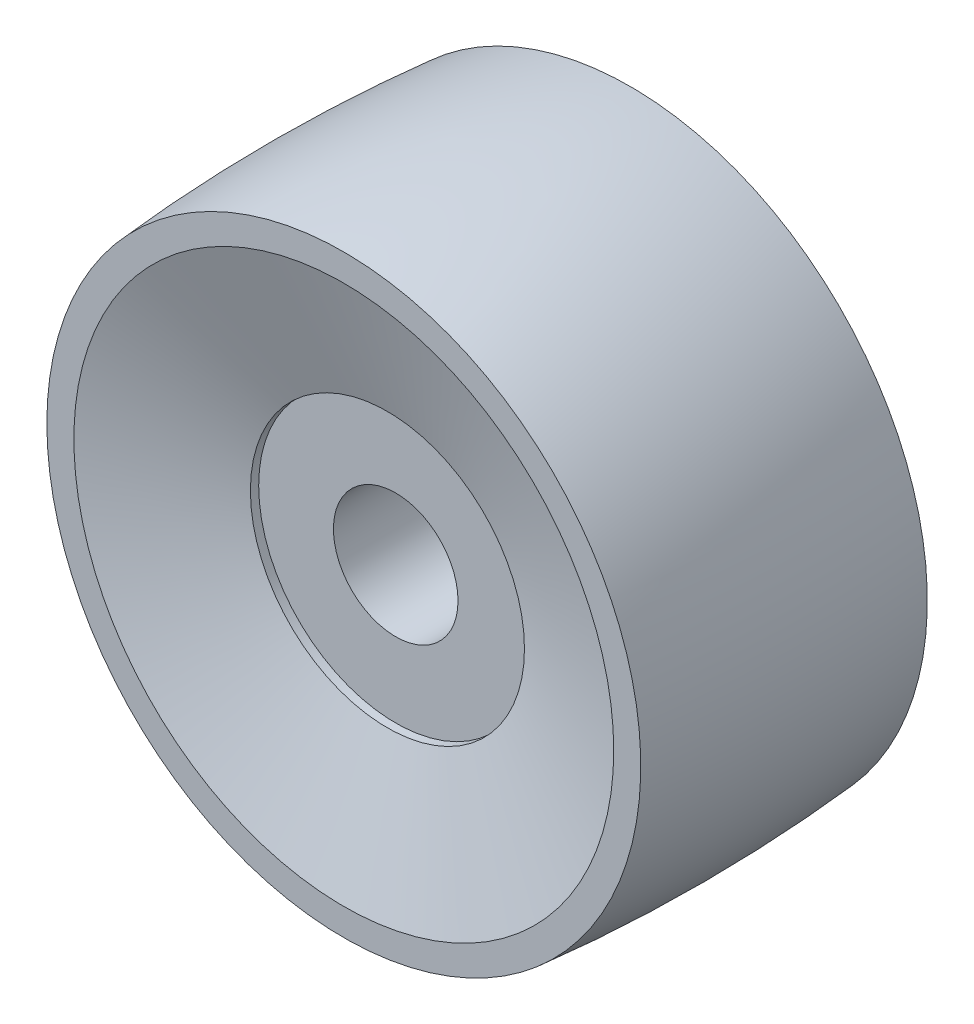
ISO-10303-21;
HEADER;
FILE_DESCRIPTION(('STEP AP214'),'2;1');
FILE_NAME('part.step','',(''),(''),'','','');
FILE_SCHEMA(('AUTOMOTIVE_DESIGN { 1 0 10303 214 1 1 1 1 }'));
ENDSEC;
DATA;
#1=APPLICATION_CONTEXT('core data for automotive mechanical design processes');
#2=APPLICATION_PROTOCOL_DEFINITION('international standard','automotive_design',2000,#1);
#3=PRODUCT_CONTEXT('',#1,'mechanical');
#4=PRODUCT('Part','Part','',(#3));
#5=PRODUCT_RELATED_PRODUCT_CATEGORY('part','',(#4));
#6=PRODUCT_DEFINITION_FORMATION('','',#4);
#7=PRODUCT_DEFINITION_CONTEXT('part definition',#1,'design');
#8=PRODUCT_DEFINITION('design','',#6,#7);
#9=PRODUCT_DEFINITION_SHAPE('','',#8);
#10=(LENGTH_UNIT() NAMED_UNIT(*) SI_UNIT(.MILLI.,.METRE.));
#11=(NAMED_UNIT(*) PLANE_ANGLE_UNIT() SI_UNIT($,.RADIAN.));
#12=(NAMED_UNIT(*) SI_UNIT($,.STERADIAN.) SOLID_ANGLE_UNIT());
#13=UNCERTAINTY_MEASURE_WITH_UNIT(LENGTH_MEASURE(1.E-05),#10,'distance_accuracy_value','');
#14=(GEOMETRIC_REPRESENTATION_CONTEXT(3) GLOBAL_UNCERTAINTY_ASSIGNED_CONTEXT((#13)) GLOBAL_UNIT_ASSIGNED_CONTEXT((#10,
#11,#12)) REPRESENTATION_CONTEXT('',''));
#15=CARTESIAN_POINT('',(0.,0.,0.));
#16=DIRECTION('',(0.,0.,1.));
#17=DIRECTION('',(1.,0.,0.));
#18=AXIS2_PLACEMENT_3D('',#15,#16,#17);
#19=CARTESIAN_POINT('',(0.,-7.5,-11.));
#20=DIRECTION('',(0.,0.,-1.));
#21=DIRECTION('',(1.,0.,0.));
#22=AXIS2_PLACEMENT_3D('',#19,#20,#21);
#23=PLANE('',#22);
#24=CARTESIAN_POINT('',(0.,0.,-11.));
#25=DIRECTION('',(0.,0.,-1.));
#26=DIRECTION('',(1.,0.,0.));
#27=AXIS2_PLACEMENT_3D('',#24,#25,#26);
#28=CIRCLE('',#27,16.5);
#29=CARTESIAN_POINT('',(16.5,0.,-11.));
#30=VERTEX_POINT('',#29);
#31=EDGE_CURVE('E40',#30,#30,#28,.T.);
#32=ORIENTED_EDGE('',*,*,#31,.T.);
#33=EDGE_LOOP('',(#32));
#34=FACE_BOUND('',#33,.T.);
#35=CARTESIAN_POINT('',(0.,0.,-11.));
#36=DIRECTION('',(0.,0.,-1.));
#37=DIRECTION('',(1.,0.,0.));
#38=AXIS2_PLACEMENT_3D('',#35,#36,#37);
#39=CIRCLE('',#38,7.5);
#40=CARTESIAN_POINT('',(7.5,0.,-11.));
#41=VERTEX_POINT('',#40);
#42=EDGE_CURVE('E8',#41,#41,#39,.T.);
#43=ORIENTED_EDGE('',*,*,#42,.F.);
#44=EDGE_LOOP('',(#43));
#45=FACE_BOUND('',#44,.T.);
#46=ADVANCED_FACE('F12',(#34,#45),#23,.T.);
#47=CARTESIAN_POINT('',(0.,0.,-20.));
#48=DIRECTION('',(0.,0.,-1.));
#49=DIRECTION('',(1.,0.,0.));
#50=AXIS2_PLACEMENT_3D('',#47,#48,#49);
#51=CYLINDRICAL_SURFACE('',#50,7.5);
#52=ORIENTED_EDGE('',*,*,#42,.T.);
#53=EDGE_LOOP('',(#52));
#54=FACE_BOUND('',#53,.T.);
#55=CARTESIAN_POINT('',(0.,0.,11.));
#56=DIRECTION('',(0.,0.,-1.));
#57=DIRECTION('',(1.,0.,0.));
#58=AXIS2_PLACEMENT_3D('',#55,#56,#57);
#59=CIRCLE('',#58,7.5);
#60=CARTESIAN_POINT('',(7.5,0.,11.));
#61=VERTEX_POINT('',#60);
#62=EDGE_CURVE('E18',#61,#61,#59,.T.);
#63=ORIENTED_EDGE('',*,*,#62,.F.);
#64=EDGE_LOOP('',(#63));
#65=FACE_BOUND('',#64,.T.);
#66=ADVANCED_FACE('F67',(#54,#65),#51,.F.);
#67=CARTESIAN_POINT('',(0.,-7.5,11.));
#68=DIRECTION('',(0.,0.,-1.));
#69=DIRECTION('',(1.,0.,0.));
#70=AXIS2_PLACEMENT_3D('',#67,#68,#69);
#71=PLANE('',#70);
#72=CARTESIAN_POINT('',(0.,0.,11.));
#73=DIRECTION('',(0.,0.,-1.));
#74=DIRECTION('',(1.,0.,0.));
#75=AXIS2_PLACEMENT_3D('',#72,#73,#74);
#76=CIRCLE('',#75,16.5);
#77=CARTESIAN_POINT('',(16.5,0.,11.));
#78=VERTEX_POINT('',#77);
#79=EDGE_CURVE('E22',#78,#78,#76,.T.);
#80=ORIENTED_EDGE('',*,*,#79,.F.);
#81=EDGE_LOOP('',(#80));
#82=FACE_BOUND('',#81,.T.);
#83=ORIENTED_EDGE('',*,*,#62,.T.);
#84=EDGE_LOOP('',(#83));
#85=FACE_BOUND('',#84,.T.);
#86=ADVANCED_FACE('F73',(#82,#85),#71,.F.);
#87=CARTESIAN_POINT('',(0.,0.,-20.));
#88=DIRECTION('',(0.,0.,-1.));
#89=DIRECTION('',(1.,0.,0.));
#90=AXIS2_PLACEMENT_3D('',#87,#88,#89);
#91=CYLINDRICAL_SURFACE('',#90,16.5);
#92=CARTESIAN_POINT('',(0.,0.,12.));
#93=DIRECTION('',(0.,0.,-1.));
#94=DIRECTION('',(1.,0.,0.));
#95=AXIS2_PLACEMENT_3D('',#92,#93,#94);
#96=CIRCLE('',#95,16.5);
#97=CARTESIAN_POINT('',(16.5,0.,12.));
#98=VERTEX_POINT('',#97);
#99=EDGE_CURVE('E26',#98,#98,#96,.T.);
#100=ORIENTED_EDGE('',*,*,#99,.F.);
#101=EDGE_LOOP('',(#100));
#102=FACE_BOUND('',#101,.T.);
#103=ORIENTED_EDGE('',*,*,#79,.T.);
#104=EDGE_LOOP('',(#103));
#105=FACE_BOUND('',#104,.T.);
#106=ADVANCED_FACE('F81',(#102,#105),#91,.F.);
#107=CARTESIAN_POINT('',(0.,0.,12.));
#108=DIRECTION('',(0.,0.,1.));
#109=DIRECTION('',(-1.,0.,0.));
#110=AXIS2_PLACEMENT_3D('',#107,#108,#109);
#111=CONICAL_SURFACE('',#110,16.5,1.25374057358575);
#112=CARTESIAN_POINT('',(0.,0.,17.25));
#113=DIRECTION('',(0.,0.,-1.));
#114=DIRECTION('',(1.,0.,0.));
#115=AXIS2_PLACEMENT_3D('',#112,#113,#114);
#116=CIRCLE('',#115,32.5);
#117=CARTESIAN_POINT('',(32.5,0.,17.25));
#118=VERTEX_POINT('',#117);
#119=EDGE_CURVE('E31',#118,#118,#116,.T.);
#120=ORIENTED_EDGE('',*,*,#119,.F.);
#121=EDGE_LOOP('',(#120));
#122=FACE_BOUND('',#121,.T.);
#123=ORIENTED_EDGE('',*,*,#99,.T.);
#124=EDGE_LOOP('',(#123));
#125=FACE_BOUND('',#124,.T.);
#126=ADVANCED_FACE('F88',(#122,#125),#111,.F.);
#127=CARTESIAN_POINT('',(0.,-36.5,17.25));
#128=DIRECTION('',(0.,0.,1.));
#129=DIRECTION('',(-1.,0.,0.));
#130=AXIS2_PLACEMENT_3D('',#127,#128,#129);
#131=PLANE('',#130);
#132=CARTESIAN_POINT('',(0.,0.,17.25));
#133=DIRECTION('',(0.,0.,1.));
#134=DIRECTION('',(-1.,0.,0.));
#135=AXIS2_PLACEMENT_3D('',#132,#133,#134);
#136=CIRCLE('',#135,35.7547050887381);
#137=CARTESIAN_POINT('',(-35.7547050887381,0.,17.25));
#138=VERTEX_POINT('',#137);
#139=EDGE_CURVE('E46',#138,#138,#136,.T.);
#140=ORIENTED_EDGE('',*,*,#139,.T.);
#141=EDGE_LOOP('',(#140));
#142=FACE_BOUND('',#141,.T.);
#143=ORIENTED_EDGE('',*,*,#119,.T.);
#144=EDGE_LOOP('',(#143));
#145=FACE_BOUND('',#144,.T.);
#146=ADVANCED_FACE('F50',(#142,#145),#131,.T.);
#147=CARTESIAN_POINT('',(0.,-36.5,-17.25));
#148=DIRECTION('',(0.,0.,1.));
#149=DIRECTION('',(-1.,0.,0.));
#150=AXIS2_PLACEMENT_3D('',#147,#148,#149);
#151=PLANE('',#150);
#152=CARTESIAN_POINT('',(0.,0.,-17.25));
#153=DIRECTION('',(0.,0.,1.));
#154=DIRECTION('',(-1.,0.,0.));
#155=AXIS2_PLACEMENT_3D('',#152,#153,#154);
#156=CIRCLE('',#155,35.7547050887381);
#157=CARTESIAN_POINT('',(-35.7547050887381,0.,-17.25));
#158=VERTEX_POINT('',#157);
#159=EDGE_CURVE('E43',#158,#158,#156,.T.);
#160=ORIENTED_EDGE('',*,*,#159,.F.);
#161=EDGE_LOOP('',(#160));
#162=FACE_BOUND('',#161,.T.);
#163=CARTESIAN_POINT('',(0.,0.,-17.25));
#164=DIRECTION('',(0.,0.,-1.));
#165=DIRECTION('',(1.,0.,0.));
#166=AXIS2_PLACEMENT_3D('',#163,#164,#165);
#167=CIRCLE('',#166,32.5);
#168=CARTESIAN_POINT('',(32.5,0.,-17.25));
#169=VERTEX_POINT('',#168);
#170=EDGE_CURVE('E34',#169,#169,#167,.T.);
#171=ORIENTED_EDGE('',*,*,#170,.F.);
#172=EDGE_LOOP('',(#171));
#173=FACE_BOUND('',#172,.T.);
#174=ADVANCED_FACE('F95',(#162,#173),#151,.F.);
#175=CARTESIAN_POINT('',(0.,0.,-12.));
#176=DIRECTION('',(0.,0.,-1.));
#177=DIRECTION('',(1.,0.,0.));
#178=AXIS2_PLACEMENT_3D('',#175,#176,#177);
#179=CONICAL_SURFACE('',#178,16.5,1.25374057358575);
#180=ORIENTED_EDGE('',*,*,#170,.T.);
#181=EDGE_LOOP('',(#180));
#182=FACE_BOUND('',#181,.T.);
#183=CARTESIAN_POINT('',(0.,0.,-12.));
#184=DIRECTION('',(0.,0.,-1.));
#185=DIRECTION('',(1.,0.,0.));
#186=AXIS2_PLACEMENT_3D('',#183,#184,#185);
#187=CIRCLE('',#186,16.5);
#188=CARTESIAN_POINT('',(16.5,0.,-12.));
#189=VERTEX_POINT('',#188);
#190=EDGE_CURVE('E37',#189,#189,#187,.T.);
#191=ORIENTED_EDGE('',*,*,#190,.F.);
#192=EDGE_LOOP('',(#191));
#193=FACE_BOUND('',#192,.T.);
#194=ADVANCED_FACE('F63',(#182,#193),#179,.F.);
#195=CARTESIAN_POINT('',(0.,0.,-20.));
#196=DIRECTION('',(0.,0.,-1.));
#197=DIRECTION('',(1.,0.,0.));
#198=AXIS2_PLACEMENT_3D('',#195,#196,#197);
#199=CYLINDRICAL_SURFACE('',#198,16.5);
#200=ORIENTED_EDGE('',*,*,#190,.T.);
#201=EDGE_LOOP('',(#200));
#202=FACE_BOUND('',#201,.T.);
#203=ORIENTED_EDGE('',*,*,#31,.F.);
#204=EDGE_LOOP('',(#203));
#205=FACE_BOUND('',#204,.T.);
#206=ADVANCED_FACE('F55',(#202,#205),#199,.F.);
#207=CARTESIAN_POINT('',(0.,0.,0.));
#208=DIRECTION('',(0.,0.,1.));
#209=DIRECTION('',(-1.,0.,0.));
#210=AXIS2_PLACEMENT_3D('',#207,#208,#209);
#211=DEGENERATE_TOROIDAL_SURFACE('',#210,163.5,200.,.F.);
#212=ORIENTED_EDGE('',*,*,#159,.T.);
#213=EDGE_LOOP('',(#212));
#214=FACE_BOUND('',#213,.T.);
#215=ORIENTED_EDGE('',*,*,#139,.F.);
#216=EDGE_LOOP('',(#215));
#217=FACE_BOUND('',#216,.T.);
#218=ADVANCED_FACE('F53',(#214,#217),#211,.F.);
#219=CLOSED_SHELL('',(#46,#66,#86,#106,#126,#146,#174,#194,#206,#218));
#220=MANIFOLD_SOLID_BREP('B1',#219);
#221=ADVANCED_BREP_SHAPE_REPRESENTATION('',(#18,#220),#14);
#222=SHAPE_DEFINITION_REPRESENTATION(#9,#221);
ENDSEC;
END-ISO-10303-21;
